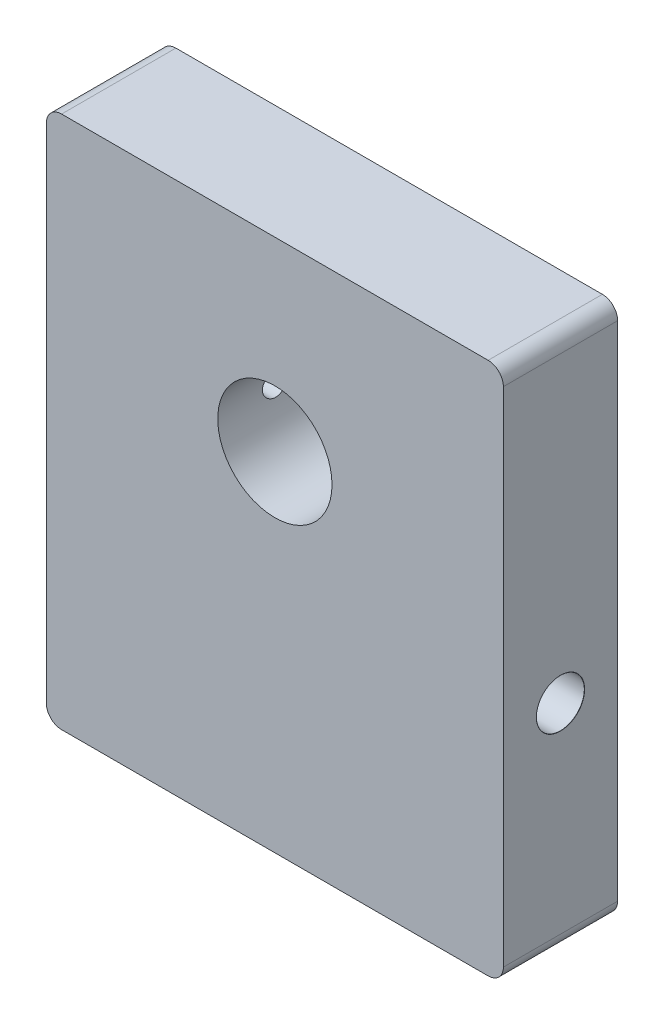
from build123d import *

# Parameters (mm, degrees)
SKETCH1_W                            = 76.2
SKETCH1_H                            = 88.9
BOSS_EXTRUDE1_DEPTH                  = 19.05
SKETCH2_R                            = 9.525
CUT_EXTRUDE1_DEPTH                   = 119.627789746
F_8_0MM_DOWEL_HOLE1_D                = 8
F_8_0MM_DOWEL_HOLE1_DEPTH            = 25.4
F_8_0MM_DOWEL_HOLE1_CSINK_D          = 8.05
F_8_0MM_DOWEL_HOLE1_CSINK_ANGLE      = 90
F_8_0MM_DOWEL_HOLE1_TIP              = 2.403442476
FILLET1_R                            = 2.54
F_8_2_8_2_DIAMETER_HOLE1_D           = 8.2
F_8_2_8_2_DIAMETER_HOLE1_DEPTH       = 25.4
F_8_2_8_2_DIAMETER_HOLE1_CSINK_D     = 8.25
F_8_2_8_2_DIAMETER_HOLE1_CSINK_ANGLE = 90
F_8_2_8_2_DIAMETER_HOLE1_TIP         = 2.463528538
SKETCH14_R                           = 2.099777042
CUT_EXTRUDE3_DEPTH                   = 38.1


with BuildPart() as part:
    # Sketch1 → Boss-Extrude1 (new body)
    with BuildSketch(Plane.XY):
        with Locations((38.1, 44.45)):
            Rectangle(SKETCH1_W, SKETCH1_H)
    extrude(amount=BOSS_EXTRUDE1_DEPTH)

    # Sketch2 → Cut-Extrude1 (cut, through all)
    with BuildSketch(Plane.XY.offset(19.05)):
        with Locations((38.1, 57.912)):
            Circle(SKETCH2_R)
    extrude(amount=-CUT_EXTRUDE1_DEPTH, mode=Mode.SUBTRACT)

    # 8.0mm Dowel Hole1
    with Locations(Plane(origin=(76.2, 0, 0), x_dir=(0, 0, -1), z_dir=(1, 0, 0))):
        with Locations((-9.525, 35.893383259)):
            CounterSinkHole(F_8_0MM_DOWEL_HOLE1_D / 2, F_8_0MM_DOWEL_HOLE1_CSINK_D / 2, depth=F_8_0MM_DOWEL_HOLE1_DEPTH, counter_sink_angle=F_8_0MM_DOWEL_HOLE1_CSINK_ANGLE)
            with Locations((0, 0, -(F_8_0MM_DOWEL_HOLE1_DEPTH + F_8_0MM_DOWEL_HOLE1_TIP / 2))):  # 118° drill point
                Cone(0, F_8_0MM_DOWEL_HOLE1_D / 2, F_8_0MM_DOWEL_HOLE1_TIP, mode=Mode.SUBTRACT)

    # Fillet1
    fillet1_edges = [part.edges().sort_by_distance(p)[0] for p in [
        (0, 88.9, 9.525),
        (76.2, 88.9, 9.525),
        (76.2, 0, 9.525),
        (0, 0, 9.525),
    ]]
    fillet(fillet1_edges, radius=FILLET1_R)

    # 8.2 _8.2_ Diameter Hole1
    with Locations(Plane(origin=(0, 0, 0), x_dir=(-1, 0, 0), z_dir=(0, -1, 0))):
        with Locations((-38.1, -9.525)):
            CounterSinkHole(F_8_2_8_2_DIAMETER_HOLE1_D / 2, F_8_2_8_2_DIAMETER_HOLE1_CSINK_D / 2, depth=F_8_2_8_2_DIAMETER_HOLE1_DEPTH, counter_sink_angle=F_8_2_8_2_DIAMETER_HOLE1_CSINK_ANGLE)
            with Locations((0, 0, -(F_8_2_8_2_DIAMETER_HOLE1_DEPTH + F_8_2_8_2_DIAMETER_HOLE1_TIP / 2))):  # 118° drill point
                Cone(0, F_8_2_8_2_DIAMETER_HOLE1_D / 2, F_8_2_8_2_DIAMETER_HOLE1_TIP, mode=Mode.SUBTRACT)

    # Sketch14 → Cut-Extrude3 (cut)
    with BuildSketch(Plane.ZY):
        with Locations((9.525, 58.42)):
            Circle(SKETCH14_R)
    extrude(amount=-CUT_EXTRUDE3_DEPTH, mode=Mode.SUBTRACT)


solid = part.part
